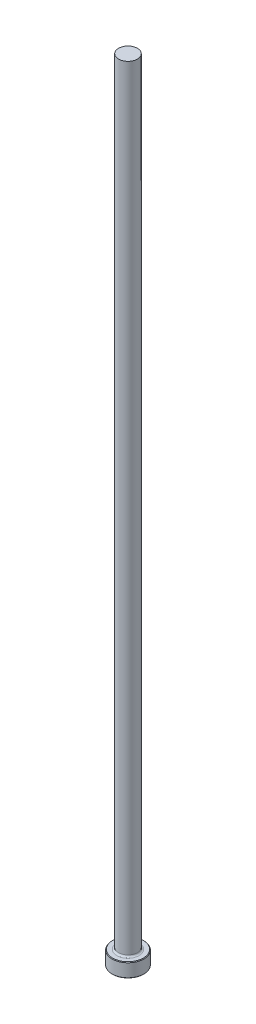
from build123d import *

# Parameters (mm, degrees)
CHAMFER1_SIZE = 0.254
FILLET1_R     = 0.762


with BuildPart() as part:
    # Sketch1 → Revolve1 (revolve)
    with BuildSketch(Plane.XY, mode=Mode.PRIVATE) as revolve1_sk:
        Polygon((0, 0), (-7.1374, 0), (-7.1374, 6.35), (-4.23037, 6.35), (-4.23037, 355.6), (0, 355.6), align=None)
    revolve(revolve1_sk.sketch.rotate(Axis((0, 259.958771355, 0), (0, -1, 0)), 270), axis=Axis((0, 259.958771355, 0), (0, -1, 0)))

    # Chamfer1
    chamfer1_edges = [part.edges().sort_by_distance(p)[0] for p in [
        (0, 6.35, -7.1374),
        (0, 0, -7.1374),
    ]]
    chamfer(chamfer1_edges, length=CHAMFER1_SIZE)

    # Fillet1
    fillet1_edges = [part.edges().sort_by_distance(p)[0] for p in [
        (0, 6.35, -4.23037),
    ]]
    fillet(fillet1_edges, radius=FILLET1_R)


solid = part.part
